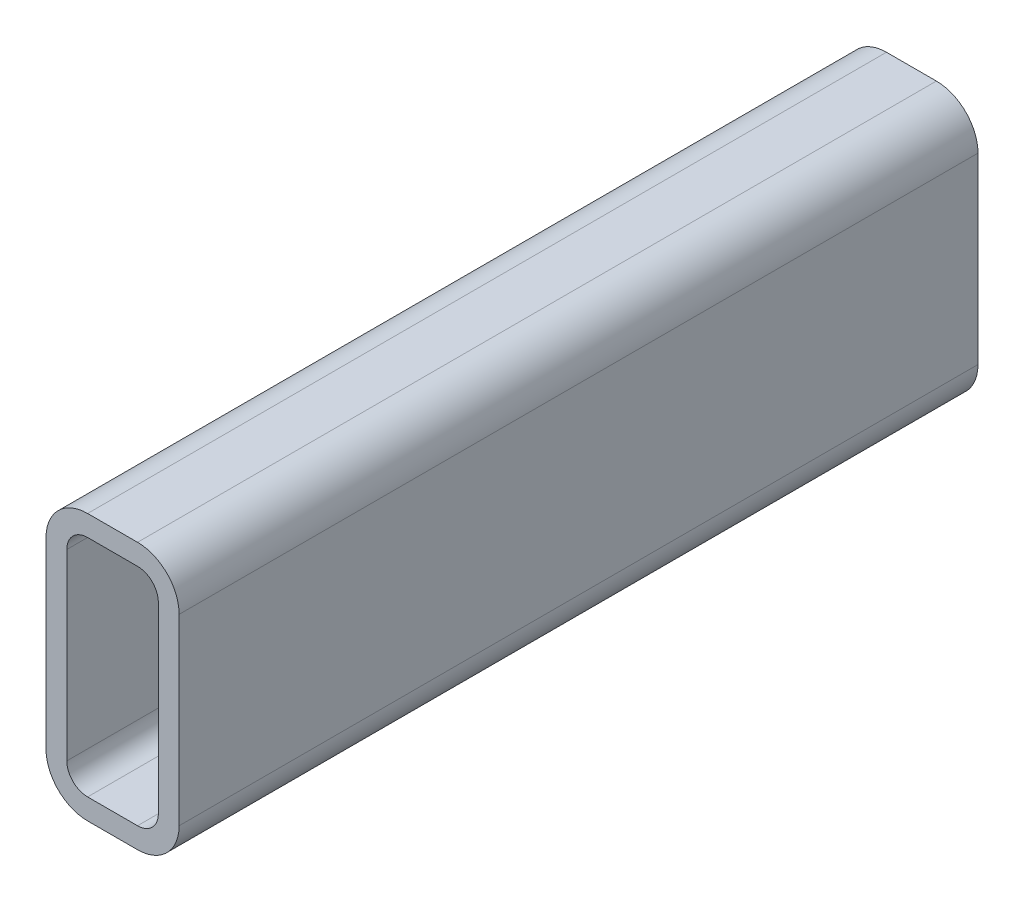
from build123d import *

# Parameters (mm, degrees)
BOSS_EXTRUDE1_DEPTH = 304.8


with BuildPart() as part:
    # Sketch1 → Boss-Extrude1 (new body)
    with BuildSketch(Plane.XY):
        with BuildLine():
            Line((15.875, 101.6), (34.925, 101.6))
            ThreePointArc((34.925, 101.6), (46.150320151, 96.950320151), (50.8, 85.725))
            Line((50.8, 85.725), (50.8, 15.875))
            ThreePointArc((50.8, 15.875), (46.150320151, 4.649679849), (34.925, 0))
            Line((34.925, 0), (15.875, 0))
            ThreePointArc((15.875, 0), (4.649679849, 4.649679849), (0, 15.875))
            Line((0, 15.875), (0, 85.725))
            ThreePointArc((0, 85.725), (4.649679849, 96.950320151), (15.875, 101.6))
        make_face()
        with BuildLine():
            Line((15.875, 93.6625), (34.925, 93.6625))
            ThreePointArc((34.925, 93.6625), (40.537660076, 91.337660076), (42.8625, 85.725))
            Line((42.8625, 85.725), (42.8625, 15.875))
            ThreePointArc((42.8625, 15.875), (40.537660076, 10.262339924), (34.925, 7.9375))
            Line((34.925, 7.9375), (15.875, 7.9375))
            ThreePointArc((15.875, 7.9375), (10.262339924, 10.262339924), (7.9375, 15.875))
            Line((7.9375, 15.875), (7.9375, 85.725))
            ThreePointArc((7.9375, 85.725), (10.262339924, 91.337660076), (15.875, 93.6625))
        make_face(mode=Mode.SUBTRACT)
    extrude(amount=BOSS_EXTRUDE1_DEPTH)


solid = part.part
